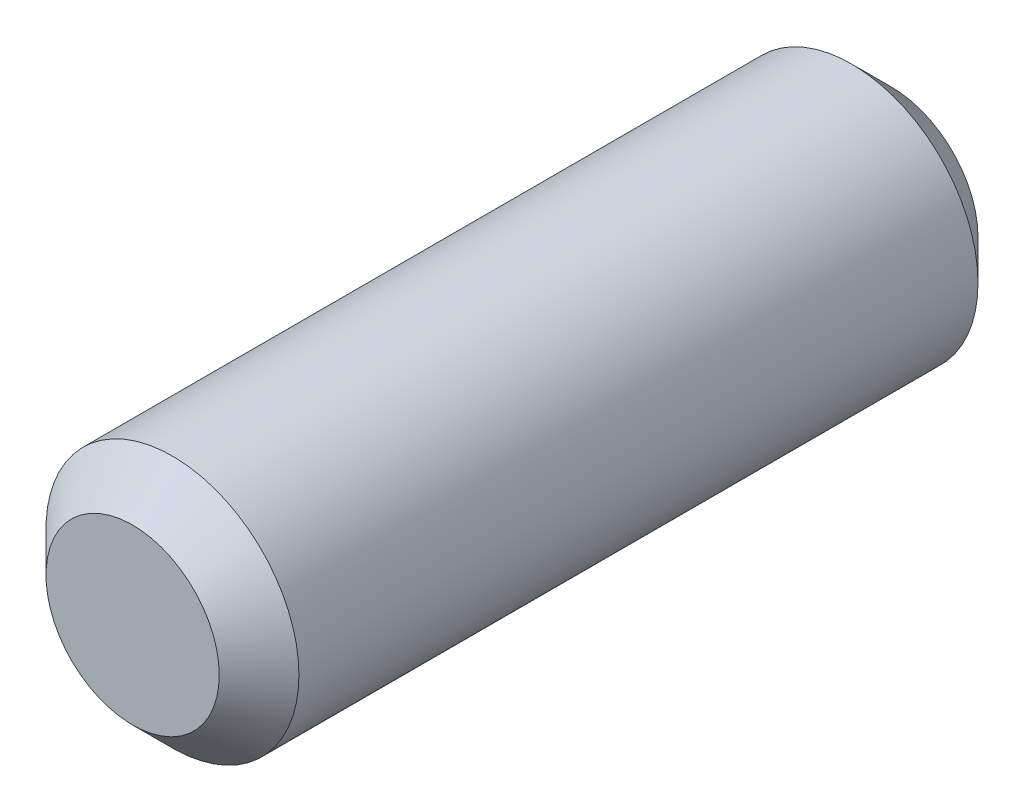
ISO-10303-21;
HEADER;
FILE_DESCRIPTION(('STEP AP214'),'2;1');
FILE_NAME('part.step','',(''),(''),'','','');
FILE_SCHEMA(('AUTOMOTIVE_DESIGN { 1 0 10303 214 1 1 1 1 }'));
ENDSEC;
DATA;
#1=APPLICATION_CONTEXT('core data for automotive mechanical design processes');
#2=APPLICATION_PROTOCOL_DEFINITION('international standard','automotive_design',2000,#1);
#3=PRODUCT_CONTEXT('',#1,'mechanical');
#4=PRODUCT('Part','Part','',(#3));
#5=PRODUCT_RELATED_PRODUCT_CATEGORY('part','',(#4));
#6=PRODUCT_DEFINITION_FORMATION('','',#4);
#7=PRODUCT_DEFINITION_CONTEXT('part definition',#1,'design');
#8=PRODUCT_DEFINITION('design','',#6,#7);
#9=PRODUCT_DEFINITION_SHAPE('','',#8);
#10=(LENGTH_UNIT() NAMED_UNIT(*) SI_UNIT(.MILLI.,.METRE.));
#11=(NAMED_UNIT(*) PLANE_ANGLE_UNIT() SI_UNIT($,.RADIAN.));
#12=(NAMED_UNIT(*) SI_UNIT($,.STERADIAN.) SOLID_ANGLE_UNIT());
#13=UNCERTAINTY_MEASURE_WITH_UNIT(LENGTH_MEASURE(1.E-05),#10,'distance_accuracy_value','');
#14=(GEOMETRIC_REPRESENTATION_CONTEXT(3) GLOBAL_UNCERTAINTY_ASSIGNED_CONTEXT((#13)) GLOBAL_UNIT_ASSIGNED_CONTEXT((#10,
#11,#12)) REPRESENTATION_CONTEXT('',''));
#15=CARTESIAN_POINT('',(0.,0.,0.));
#16=DIRECTION('',(0.,0.,1.));
#17=DIRECTION('',(1.,0.,0.));
#18=AXIS2_PLACEMENT_3D('',#15,#16,#17);
#19=CARTESIAN_POINT('',(0.,0.,6.));
#20=DIRECTION('',(0.,0.,-1.));
#21=DIRECTION('',(-1.,0.,0.));
#22=AXIS2_PLACEMENT_3D('',#19,#20,#21);
#23=CYLINDRICAL_SURFACE('',#22,2.);
#24=CARTESIAN_POINT('',(0.,0.,-5.37));
#25=DIRECTION('',(0.,0.,1.));
#26=DIRECTION('',(1.,0.,0.));
#27=AXIS2_PLACEMENT_3D('',#24,#25,#26);
#28=CIRCLE('',#27,2.);
#29=CARTESIAN_POINT('',(2.00000000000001,0.,-5.37));
#30=VERTEX_POINT('',#29);
#31=EDGE_CURVE('E33',#30,#30,#28,.T.);
#32=ORIENTED_EDGE('',*,*,#31,.T.);
#33=EDGE_LOOP('',(#32));
#34=FACE_BOUND('',#33,.T.);
#35=CARTESIAN_POINT('',(0.,0.,5.37));
#36=DIRECTION('',(0.,0.,1.));
#37=DIRECTION('',(1.,0.,0.));
#38=AXIS2_PLACEMENT_3D('',#35,#36,#37);
#39=CIRCLE('',#38,2.);
#40=CARTESIAN_POINT('',(2.,0.,5.37));
#41=VERTEX_POINT('',#40);
#42=EDGE_CURVE('E37',#41,#41,#39,.F.);
#43=ORIENTED_EDGE('',*,*,#42,.T.);
#44=EDGE_LOOP('',(#43));
#45=FACE_BOUND('',#44,.T.);
#46=ADVANCED_FACE('F23',(#34,#45),#23,.T.);
#47=CARTESIAN_POINT('',(0.,0.,6.));
#48=DIRECTION('',(0.,0.,1.));
#49=DIRECTION('',(1.,0.,0.));
#50=AXIS2_PLACEMENT_3D('',#47,#48,#49);
#51=PLANE('',#50);
#52=CARTESIAN_POINT('',(0.,0.,6.));
#53=DIRECTION('',(0.,0.,1.));
#54=DIRECTION('',(1.,0.,0.));
#55=AXIS2_PLACEMENT_3D('',#52,#53,#54);
#56=CIRCLE('',#55,1.37);
#57=CARTESIAN_POINT('',(1.37,0.,6.));
#58=VERTEX_POINT('',#57);
#59=EDGE_CURVE('E10',#58,#58,#56,.T.);
#60=ORIENTED_EDGE('',*,*,#59,.T.);
#61=EDGE_LOOP('',(#60));
#62=FACE_BOUND('',#61,.T.);
#63=ADVANCED_FACE('F56',(#62),#51,.T.);
#64=CARTESIAN_POINT('',(0.,0.,-5.99999999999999));
#65=DIRECTION('',(0.,0.,1.));
#66=DIRECTION('',(1.,0.,0.));
#67=AXIS2_PLACEMENT_3D('',#64,#65,#66);
#68=PLANE('',#67);
#69=CARTESIAN_POINT('',(0.,0.,-5.99999999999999));
#70=DIRECTION('',(0.,0.,1.));
#71=DIRECTION('',(1.,0.,0.));
#72=AXIS2_PLACEMENT_3D('',#69,#70,#71);
#73=CIRCLE('',#72,1.37);
#74=CARTESIAN_POINT('',(1.37000000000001,0.,-5.99999999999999));
#75=VERTEX_POINT('',#74);
#76=EDGE_CURVE('E29',#75,#75,#73,.F.);
#77=ORIENTED_EDGE('',*,*,#76,.T.);
#78=EDGE_LOOP('',(#77));
#79=FACE_BOUND('',#78,.T.);
#80=ADVANCED_FACE('F52',(#79),#68,.F.);
#81=CARTESIAN_POINT('',(0.,0.,-5.37));
#82=DIRECTION('',(0.,0.,1.));
#83=DIRECTION('',(1.,0.,0.));
#84=AXIS2_PLACEMENT_3D('',#81,#82,#83);
#85=CONICAL_SURFACE('',#84,2.,0.78539816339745);
#86=ORIENTED_EDGE('',*,*,#76,.F.);
#87=EDGE_LOOP('',(#86));
#88=FACE_BOUND('',#87,.T.);
#89=ORIENTED_EDGE('',*,*,#31,.F.);
#90=EDGE_LOOP('',(#89));
#91=FACE_BOUND('',#90,.T.);
#92=ADVANCED_FACE('F47',(#88,#91),#85,.T.);
#93=CARTESIAN_POINT('',(0.,0.,6.));
#94=DIRECTION('',(0.,0.,-1.));
#95=DIRECTION('',(-1.,0.,0.));
#96=AXIS2_PLACEMENT_3D('',#93,#94,#95);
#97=CONICAL_SURFACE('',#96,1.37,0.785398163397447);
#98=ORIENTED_EDGE('',*,*,#42,.F.);
#99=EDGE_LOOP('',(#98));
#100=FACE_BOUND('',#99,.T.);
#101=ORIENTED_EDGE('',*,*,#59,.F.);
#102=EDGE_LOOP('',(#101));
#103=FACE_BOUND('',#102,.T.);
#104=ADVANCED_FACE('F44',(#100,#103),#97,.T.);
#105=CLOSED_SHELL('',(#46,#63,#80,#92,#104));
#106=MANIFOLD_SOLID_BREP('B2',#105);
#107=ADVANCED_BREP_SHAPE_REPRESENTATION('',(#18,#106),#14);
#108=SHAPE_DEFINITION_REPRESENTATION(#9,#107);
ENDSEC;
END-ISO-10303-21;
